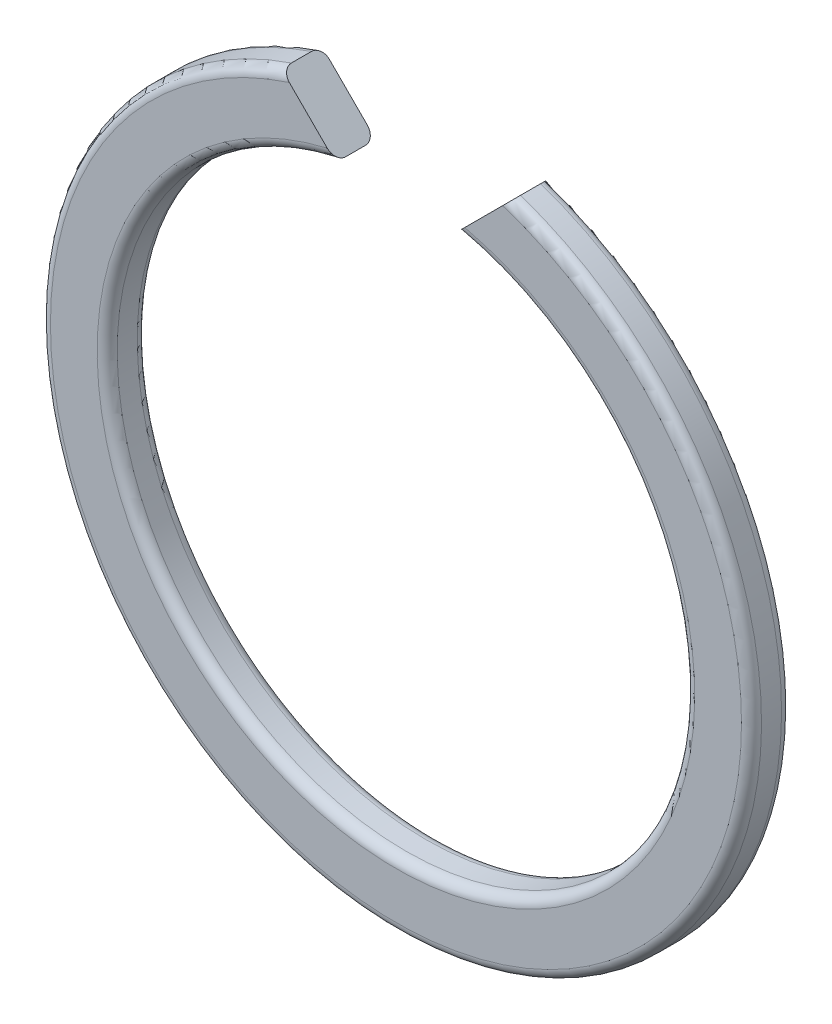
from build123d import *

# Parameters (mm, degrees)
BODYSKE_R      = 10.65
BODYSKE_R_2    = 8.65
BASEBODY_DEPTH = 1.2
SLIT_DEPTH     = 16.109103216
FILLET1_R      = 0.3


with BuildPart() as part:
    # BodySke → BaseBody (new body)
    with BuildSketch(Plane.XY):
        Circle(BODYSKE_R)
        Circle(BODYSKE_R_2, mode=Mode.SUBTRACT)
    extrude(amount=BASEBODY_DEPTH)

    # SlitSke → Slit (cut, through all)
    with BuildSketch(Plane.XY):
        Polygon((0, 6.65), (4, 10.65), (-4, 10.65), align=None)
    extrude(amount=SLIT_DEPTH, mode=Mode.SUBTRACT)

    # Fillet1
    fillet1_edges = [part.edges().sort_by_distance(p)[0] for p in [
        (0, -8.65, 0),
        (0, -10.65, 1.2),
        (0, -10.65, 0),
        (0, -8.65, 1.2),
    ]]
    fillet(fillet1_edges, radius=FILLET1_R)


solid = part.part
